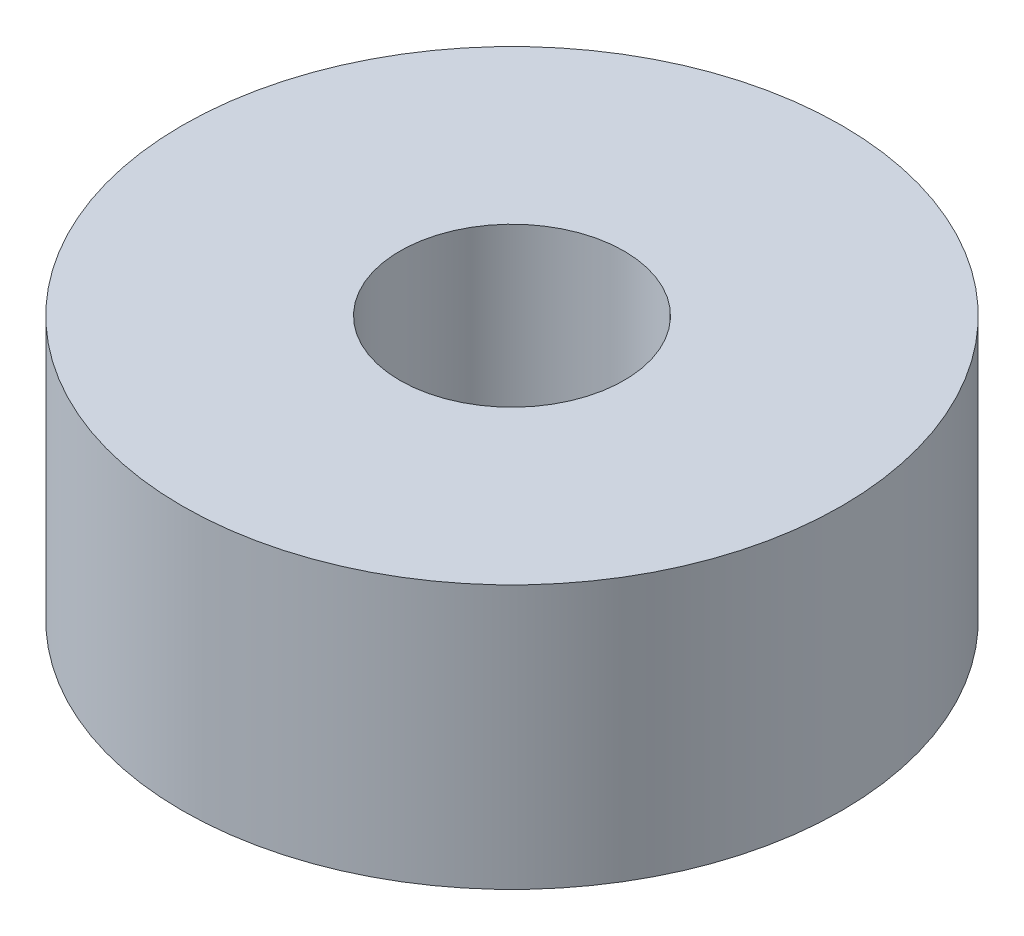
from build123d import *

# Parameters (mm, degrees)
ESQUISSE1_R      = 12.5
ESQUISSE1_R_2    = 4.25
EXTRUSION1_DEPTH = 5


with BuildPart() as part:
    # Esquisse1 → Extrusion1 (new, symmetric)
    with BuildSketch(Plane(origin=(0, 0, 0), x_dir=(1, 0, 0), z_dir=(0, 1, 0))):
        with Locations(Location((0, 0, 0), (0, 0, 270))):
            Circle(ESQUISSE1_R)
        with Locations(Location((0, 0, 0), (0, 0, 270))):
            Circle(ESQUISSE1_R_2, mode=Mode.SUBTRACT)
    extrude(amount=EXTRUSION1_DEPTH, both=True)


solid = part.part
